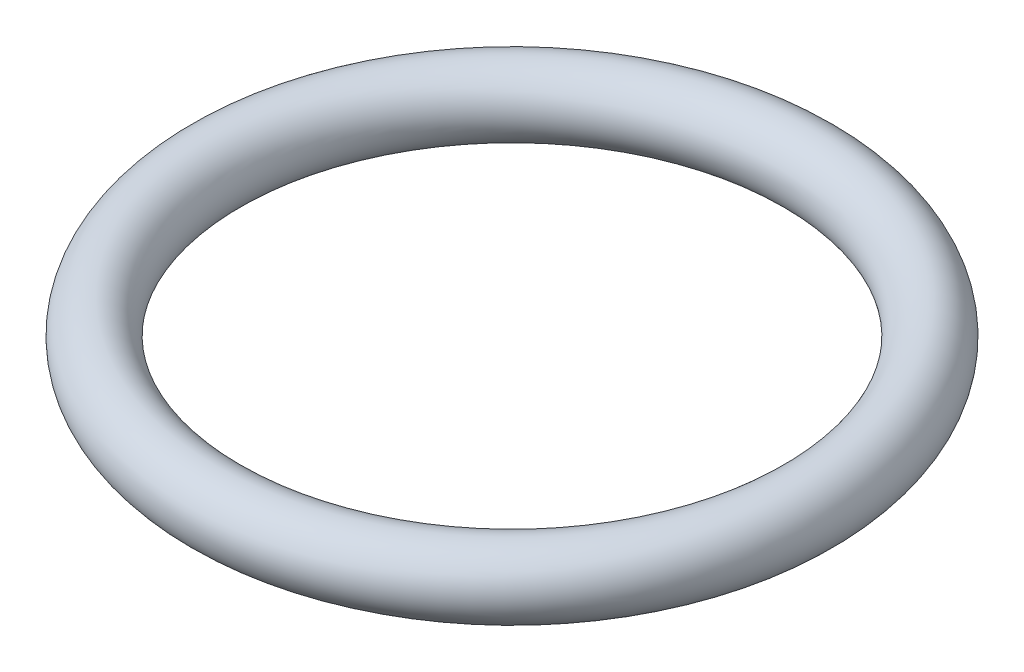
from build123d import *

# Parameters (mm, degrees)
ESQUISSE1_R = 0.65


with BuildPart() as part:
    # Esquisse1 → R_volution1 (revolve)
    with BuildSketch(Plane.XY, mode=Mode.PRIVATE) as r_volution1_sk:
        with Locations((5.65, 1.3)):
            Circle(ESQUISSE1_R)
    revolve(r_volution1_sk.sketch.rotate(Axis((0, 0, 0), (0, -1, 0)), 90), axis=Axis((0, 0, 0), (0, -1, 0)))


solid = part.part
